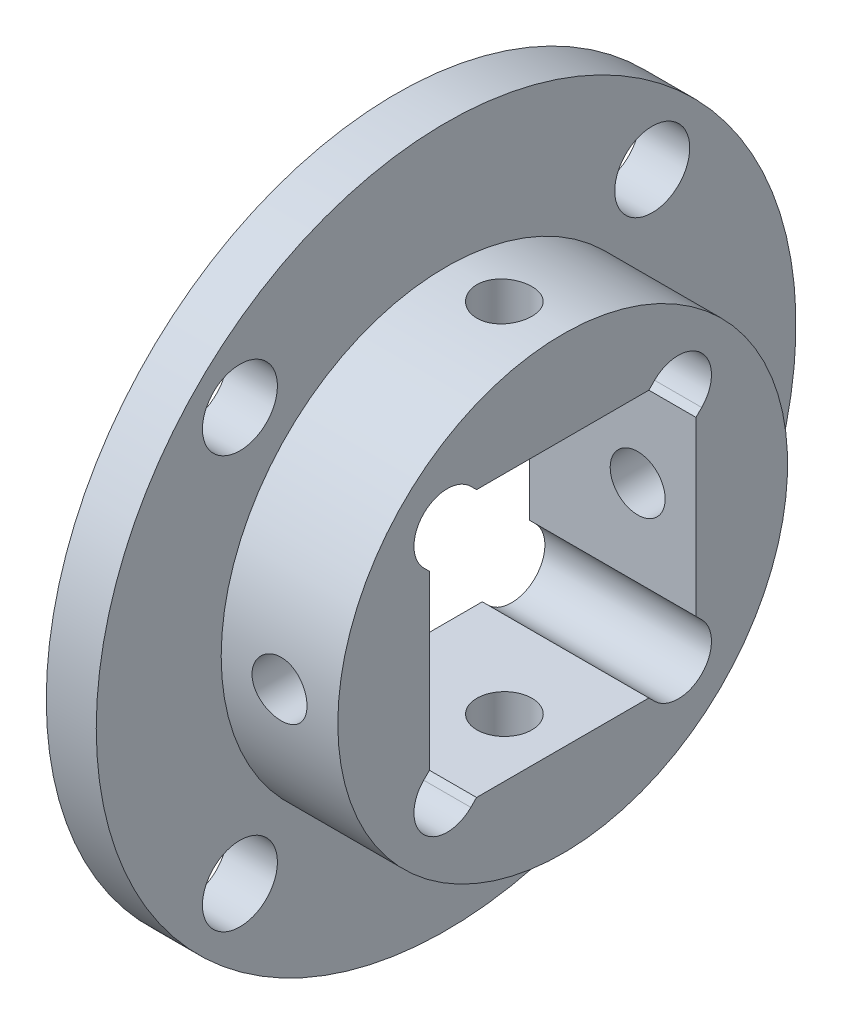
ISO-10303-21;
HEADER;
FILE_DESCRIPTION(('STEP AP214'),'2;1');
FILE_NAME('part.step','',(''),(''),'','','');
FILE_SCHEMA(('AUTOMOTIVE_DESIGN { 1 0 10303 214 1 1 1 1 }'));
ENDSEC;
DATA;
#1=APPLICATION_CONTEXT('core data for automotive mechanical design processes');
#2=APPLICATION_PROTOCOL_DEFINITION('international standard','automotive_design',2000,#1);
#3=PRODUCT_CONTEXT('',#1,'mechanical');
#4=PRODUCT('Part','Part','',(#3));
#5=PRODUCT_RELATED_PRODUCT_CATEGORY('part','',(#4));
#6=PRODUCT_DEFINITION_FORMATION('','',#4);
#7=PRODUCT_DEFINITION_CONTEXT('part definition',#1,'design');
#8=PRODUCT_DEFINITION('design','',#6,#7);
#9=PRODUCT_DEFINITION_SHAPE('','',#8);
#10=(LENGTH_UNIT() NAMED_UNIT(*) SI_UNIT(.MILLI.,.METRE.));
#11=(NAMED_UNIT(*) PLANE_ANGLE_UNIT() SI_UNIT($,.RADIAN.));
#12=(NAMED_UNIT(*) SI_UNIT($,.STERADIAN.) SOLID_ANGLE_UNIT());
#13=UNCERTAINTY_MEASURE_WITH_UNIT(LENGTH_MEASURE(1.E-05),#10,'distance_accuracy_value','');
#14=(GEOMETRIC_REPRESENTATION_CONTEXT(3) GLOBAL_UNCERTAINTY_ASSIGNED_CONTEXT((#13)) GLOBAL_UNIT_ASSIGNED_CONTEXT((#10,
#11,#12)) REPRESENTATION_CONTEXT('',''));
#15=CARTESIAN_POINT('',(0.,0.,0.));
#16=DIRECTION('',(0.,0.,1.));
#17=DIRECTION('',(1.,0.,0.));
#18=AXIS2_PLACEMENT_3D('',#15,#16,#17);
#19=CARTESIAN_POINT('',(0.,8.,8.));
#20=DIRECTION('',(0.,1.,0.));
#21=DIRECTION('',(0.,0.,1.));
#22=AXIS2_PLACEMENT_3D('',#19,#20,#21);
#23=PLANE('',#22);
#24=DIRECTION('',(0.,0.,1.));
#25=VECTOR('',#24,1.);
#26=CARTESIAN_POINT('',(10.,8.,8.));
#27=LINE('',#26,#25);
#28=CARTESIAN_POINT('',(10.,8.,-5.17157287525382));
#29=VERTEX_POINT('',#28);
#30=CARTESIAN_POINT('',(10.,8.00000000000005,5.17157287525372));
#31=VERTEX_POINT('',#30);
#32=EDGE_CURVE('E296',#29,#31,#27,.T.);
#33=ORIENTED_EDGE('',*,*,#32,.T.);
#34=DIRECTION('',(1.,0.,0.));
#35=VECTOR('',#34,1.);
#36=CARTESIAN_POINT('',(0.,8.00000000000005,5.17157287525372));
#37=LINE('',#36,#35);
#38=CARTESIAN_POINT('',(0.,8.00000000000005,5.17157287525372));
#39=VERTEX_POINT('',#38);
#40=EDGE_CURVE('E180',#39,#31,#37,.T.);
#41=ORIENTED_EDGE('',*,*,#40,.F.);
#42=DIRECTION('',(0.,0.,1.));
#43=VECTOR('',#42,1.);
#44=CARTESIAN_POINT('',(0.,8.,8.));
#45=LINE('',#44,#43);
#46=CARTESIAN_POINT('',(0.,8.,-5.17157287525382));
#47=VERTEX_POINT('',#46);
#48=EDGE_CURVE('E300',#47,#39,#45,.T.);
#49=ORIENTED_EDGE('',*,*,#48,.F.);
#50=DIRECTION('',(1.,0.,0.));
#51=VECTOR('',#50,1.);
#52=CARTESIAN_POINT('',(0.,8.,-5.17157287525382));
#53=LINE('',#52,#51);
#54=EDGE_CURVE('E259',#47,#29,#53,.T.);
#55=ORIENTED_EDGE('',*,*,#54,.T.);
#56=EDGE_LOOP('',(#33,#41,#49,#55));
#57=FACE_BOUND('',#56,.T.);
#58=CARTESIAN_POINT('',(6.5,8.,0.));
#59=DIRECTION('',(0.,-1.,0.));
#60=DIRECTION('',(0.,0.,-1.));
#61=AXIS2_PLACEMENT_3D('',#58,#59,#60);
#62=CIRCLE('',#61,1.64999999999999);
#63=CARTESIAN_POINT('',(6.5,8.,-1.64999999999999));
#64=VERTEX_POINT('',#63);
#65=EDGE_CURVE('E265',#64,#64,#62,.T.);
#66=ORIENTED_EDGE('',*,*,#65,.F.);
#67=EDGE_LOOP('',(#66));
#68=FACE_BOUND('',#67,.T.);
#69=ADVANCED_FACE('F32',(#57,#68),#23,.F.);
#70=CARTESIAN_POINT('',(0.,8.,8.));
#71=DIRECTION('',(0.,0.,1.));
#72=DIRECTION('',(0.,-1.,0.));
#73=AXIS2_PLACEMENT_3D('',#70,#71,#72);
#74=PLANE('',#73);
#75=DIRECTION('',(0.,-1.,0.));
#76=VECTOR('',#75,1.);
#77=CARTESIAN_POINT('',(0.,8.,8.));
#78=LINE('',#77,#76);
#79=CARTESIAN_POINT('',(0.,5.1715728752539,7.99999999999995));
#80=VERTEX_POINT('',#79);
#81=CARTESIAN_POINT('',(0.,-5.17157287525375,8.00000000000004));
#82=VERTEX_POINT('',#81);
#83=EDGE_CURVE('E293',#80,#82,#78,.T.);
#84=ORIENTED_EDGE('',*,*,#83,.F.);
#85=DIRECTION('',(1.,0.,0.));
#86=VECTOR('',#85,1.);
#87=CARTESIAN_POINT('',(0.,5.1715728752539,7.99999999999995));
#88=LINE('',#87,#86);
#89=CARTESIAN_POINT('',(10.,5.1715728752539,7.99999999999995));
#90=VERTEX_POINT('',#89);
#91=EDGE_CURVE('E157',#80,#90,#88,.T.);
#92=ORIENTED_EDGE('',*,*,#91,.T.);
#93=DIRECTION('',(0.,-1.,0.));
#94=VECTOR('',#93,1.);
#95=CARTESIAN_POINT('',(10.,8.,8.));
#96=LINE('',#95,#94);
#97=CARTESIAN_POINT('',(10.,-5.17157287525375,8.00000000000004));
#98=VERTEX_POINT('',#97);
#99=EDGE_CURVE('E303',#90,#98,#96,.T.);
#100=ORIENTED_EDGE('',*,*,#99,.T.);
#101=DIRECTION('',(1.,0.,0.));
#102=VECTOR('',#101,1.);
#103=CARTESIAN_POINT('',(0.,-5.17157287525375,8.00000000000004));
#104=LINE('',#103,#102);
#105=EDGE_CURVE('E202',#82,#98,#104,.T.);
#106=ORIENTED_EDGE('',*,*,#105,.F.);
#107=EDGE_LOOP('',(#84,#92,#100,#106));
#108=FACE_BOUND('',#107,.T.);
#109=CARTESIAN_POINT('',(6.5,0.,8.));
#110=DIRECTION('',(0.,0.,-1.));
#111=DIRECTION('',(0.,1.,0.));
#112=AXIS2_PLACEMENT_3D('',#109,#110,#111);
#113=CIRCLE('',#112,1.64999999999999);
#114=CARTESIAN_POINT('',(6.5,1.65000000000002,7.99999999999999));
#115=VERTEX_POINT('',#114);
#116=EDGE_CURVE('E269',#115,#115,#113,.T.);
#117=ORIENTED_EDGE('',*,*,#116,.F.);
#118=EDGE_LOOP('',(#117));
#119=FACE_BOUND('',#118,.T.);
#120=ADVANCED_FACE('F365',(#108,#119),#74,.F.);
#121=CARTESIAN_POINT('',(0.,-8.,8.));
#122=DIRECTION('',(0.,-1.,0.));
#123=DIRECTION('',(0.,0.,-1.));
#124=AXIS2_PLACEMENT_3D('',#121,#122,#123);
#125=PLANE('',#124);
#126=DIRECTION('',(0.,0.,-1.));
#127=VECTOR('',#126,1.);
#128=CARTESIAN_POINT('',(0.,-8.,8.));
#129=LINE('',#128,#127);
#130=CARTESIAN_POINT('',(0.,-7.99999999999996,5.17157287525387));
#131=VERTEX_POINT('',#130);
#132=CARTESIAN_POINT('',(0.,-8.00000000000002,-5.17157287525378));
#133=VERTEX_POINT('',#132);
#134=EDGE_CURVE('E295',#131,#133,#129,.T.);
#135=ORIENTED_EDGE('',*,*,#134,.F.);
#136=DIRECTION('',(1.,0.,0.));
#137=VECTOR('',#136,1.);
#138=CARTESIAN_POINT('',(0.,-7.99999999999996,5.17157287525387));
#139=LINE('',#138,#137);
#140=CARTESIAN_POINT('',(10.,-7.99999999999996,5.17157287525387));
#141=VERTEX_POINT('',#140);
#142=EDGE_CURVE('E205',#131,#141,#139,.T.);
#143=ORIENTED_EDGE('',*,*,#142,.T.);
#144=DIRECTION('',(0.,0.,-1.));
#145=VECTOR('',#144,1.);
#146=CARTESIAN_POINT('',(10.,-8.,8.));
#147=LINE('',#146,#145);
#148=CARTESIAN_POINT('',(10.,-8.00000000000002,-5.17157287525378));
#149=VERTEX_POINT('',#148);
#150=EDGE_CURVE('E305',#141,#149,#147,.T.);
#151=ORIENTED_EDGE('',*,*,#150,.T.);
#152=DIRECTION('',(1.,0.,0.));
#153=VECTOR('',#152,1.);
#154=CARTESIAN_POINT('',(0.,-8.00000000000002,-5.17157287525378));
#155=LINE('',#154,#153);
#156=EDGE_CURVE('E229',#133,#149,#155,.T.);
#157=ORIENTED_EDGE('',*,*,#156,.F.);
#158=EDGE_LOOP('',(#135,#143,#151,#157));
#159=FACE_BOUND('',#158,.T.);
#160=CARTESIAN_POINT('',(6.5,-8.,0.));
#161=DIRECTION('',(0.,1.,0.));
#162=DIRECTION('',(0.,0.,1.));
#163=AXIS2_PLACEMENT_3D('',#160,#161,#162);
#164=CIRCLE('',#163,1.64999999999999);
#165=CARTESIAN_POINT('',(6.5,-8.,1.64999999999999));
#166=VERTEX_POINT('',#165);
#167=EDGE_CURVE('E273',#166,#166,#164,.T.);
#168=ORIENTED_EDGE('',*,*,#167,.F.);
#169=EDGE_LOOP('',(#168));
#170=FACE_BOUND('',#169,.T.);
#171=ADVANCED_FACE('F371',(#159,#170),#125,.F.);
#172=CARTESIAN_POINT('',(0.,0.,0.));
#173=DIRECTION('',(1.,0.,0.));
#174=DIRECTION('',(0.,0.,-1.));
#175=AXIS2_PLACEMENT_3D('',#172,#173,#174);
#176=PLANE('',#175);
#177=CARTESIAN_POINT('',(0.,-12.3743686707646,12.3743686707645));
#178=DIRECTION('',(1.,0.,0.));
#179=DIRECTION('',(0.,0.,-1.));
#180=AXIS2_PLACEMENT_3D('',#177,#178,#179);
#181=CIRCLE('',#180,2.25);
#182=CARTESIAN_POINT('',(0.,-12.3743686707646,10.1243686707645));
#183=VERTEX_POINT('',#182);
#184=EDGE_CURVE('E277',#183,#183,#181,.T.);
#185=ORIENTED_EDGE('',*,*,#184,.T.);
#186=EDGE_LOOP('',(#185));
#187=FACE_BOUND('',#186,.T.);
#188=CARTESIAN_POINT('',(0.,-12.3743686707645,-12.3743686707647));
#189=DIRECTION('',(1.,0.,0.));
#190=DIRECTION('',(0.,0.,-1.));
#191=AXIS2_PLACEMENT_3D('',#188,#189,#190);
#192=CIRCLE('',#191,2.25);
#193=CARTESIAN_POINT('',(0.,-12.3743686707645,-14.6243686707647));
#194=VERTEX_POINT('',#193);
#195=EDGE_CURVE('E281',#194,#194,#192,.T.);
#196=ORIENTED_EDGE('',*,*,#195,.T.);
#197=EDGE_LOOP('',(#196));
#198=FACE_BOUND('',#197,.T.);
#199=CARTESIAN_POINT('',(0.,12.3743686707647,-12.3743686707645));
#200=DIRECTION('',(1.,0.,0.));
#201=DIRECTION('',(0.,0.,-1.));
#202=AXIS2_PLACEMENT_3D('',#199,#200,#201);
#203=CIRCLE('',#202,2.25);
#204=CARTESIAN_POINT('',(0.,12.3743686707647,-14.6243686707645));
#205=VERTEX_POINT('',#204);
#206=EDGE_CURVE('E285',#205,#205,#203,.T.);
#207=ORIENTED_EDGE('',*,*,#206,.T.);
#208=EDGE_LOOP('',(#207));
#209=FACE_BOUND('',#208,.T.);
#210=CARTESIAN_POINT('',(0.,12.3743686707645,12.3743686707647));
#211=DIRECTION('',(1.,0.,0.));
#212=DIRECTION('',(0.,0.,-1.));
#213=AXIS2_PLACEMENT_3D('',#210,#211,#212);
#214=CIRCLE('',#213,2.25);
#215=CARTESIAN_POINT('',(0.,12.3743686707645,10.1243686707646));
#216=VERTEX_POINT('',#215);
#217=EDGE_CURVE('E289',#216,#216,#214,.T.);
#218=ORIENTED_EDGE('',*,*,#217,.T.);
#219=EDGE_LOOP('',(#218));
#220=FACE_BOUND('',#219,.T.);
#221=ORIENTED_EDGE('',*,*,#48,.T.);
#222=DIRECTION('',(0.,0.707106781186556,0.707106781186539));
#223=VECTOR('',#222,1.);
#224=CARTESIAN_POINT('',(0.,8.34386001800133,5.51543289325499));
#225=LINE('',#224,#223);
#226=CARTESIAN_POINT('',(0.,8.34386001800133,5.51543289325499));
#227=VERTEX_POINT('',#226);
#228=EDGE_CURVE('E158',#39,#227,#225,.T.);
#229=ORIENTED_EDGE('',*,*,#228,.T.);
#230=CARTESIAN_POINT('',(0.,6.92964645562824,6.92964645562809));
#231=DIRECTION('',(1.,0.,0.));
#232=DIRECTION('',(0.,0.,-1.));
#233=AXIS2_PLACEMENT_3D('',#230,#231,#232);
#234=CIRCLE('',#233,2.);
#235=CARTESIAN_POINT('',(0.,5.51543289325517,8.34386001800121));
#236=VERTEX_POINT('',#235);
#237=EDGE_CURVE('E153',#227,#236,#234,.T.);
#238=ORIENTED_EDGE('',*,*,#237,.T.);
#239=DIRECTION('',(0.,-0.70710678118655,-0.707106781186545));
#240=VECTOR('',#239,1.);
#241=CARTESIAN_POINT('',(0.,5.51543289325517,8.34386001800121));
#242=LINE('',#241,#240);
#243=EDGE_CURVE('E161',#236,#80,#242,.T.);
#244=ORIENTED_EDGE('',*,*,#243,.T.);
#245=ORIENTED_EDGE('',*,*,#83,.T.);
#246=DIRECTION('',(0.,-0.707106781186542,0.707106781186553));
#247=VECTOR('',#246,1.);
#248=CARTESIAN_POINT('',(0.,-5.51543289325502,8.34386001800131));
#249=LINE('',#248,#247);
#250=CARTESIAN_POINT('',(0.,-5.51543289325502,8.34386001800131));
#251=VERTEX_POINT('',#250);
#252=EDGE_CURVE('E190',#82,#251,#249,.T.);
#253=ORIENTED_EDGE('',*,*,#252,.T.);
#254=CARTESIAN_POINT('',(0.,-6.92964645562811,6.92964645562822));
#255=DIRECTION('',(1.,0.,0.));
#256=DIRECTION('',(0.,0.,-1.));
#257=AXIS2_PLACEMENT_3D('',#254,#255,#256);
#258=CIRCLE('',#257,2.);
#259=CARTESIAN_POINT('',(0.,-8.34386001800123,5.51543289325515));
#260=VERTEX_POINT('',#259);
#261=EDGE_CURVE('E183',#251,#260,#258,.T.);
#262=ORIENTED_EDGE('',*,*,#261,.T.);
#263=DIRECTION('',(0.,0.707106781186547,-0.707106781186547));
#264=VECTOR('',#263,1.);
#265=CARTESIAN_POINT('',(0.,-8.34386001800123,5.51543289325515));
#266=LINE('',#265,#264);
#267=EDGE_CURVE('E186',#260,#131,#266,.T.);
#268=ORIENTED_EDGE('',*,*,#267,.T.);
#269=ORIENTED_EDGE('',*,*,#134,.T.);
#270=DIRECTION('',(0.,-0.707106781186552,-0.707106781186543));
#271=VECTOR('',#270,1.);
#272=CARTESIAN_POINT('',(0.,-8.34386001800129,-5.51543289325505));
#273=LINE('',#272,#271);
#274=CARTESIAN_POINT('',(0.,-8.34386001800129,-5.51543289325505));
#275=VERTEX_POINT('',#274);
#276=EDGE_CURVE('E216',#133,#275,#273,.T.);
#277=ORIENTED_EDGE('',*,*,#276,.T.);
#278=CARTESIAN_POINT('',(0.,-6.92964645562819,-6.92964645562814));
#279=DIRECTION('',(1.,0.,0.));
#280=DIRECTION('',(0.,0.,-1.));
#281=AXIS2_PLACEMENT_3D('',#278,#279,#280);
#282=CIRCLE('',#281,2.);
#283=CARTESIAN_POINT('',(0.,-5.51543289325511,-8.34386001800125));
#284=VERTEX_POINT('',#283);
#285=EDGE_CURVE('E209',#275,#284,#282,.T.);
#286=ORIENTED_EDGE('',*,*,#285,.T.);
#287=DIRECTION('',(0.,0.707106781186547,0.707106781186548));
#288=VECTOR('',#287,1.);
#289=CARTESIAN_POINT('',(0.,-5.51543289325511,-8.34386001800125));
#290=LINE('',#289,#288);
#291=CARTESIAN_POINT('',(0.,-5.17157287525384,-7.99999999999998));
#292=VERTEX_POINT('',#291);
#293=EDGE_CURVE('E212',#284,#292,#290,.T.);
#294=ORIENTED_EDGE('',*,*,#293,.T.);
#295=DIRECTION('',(0.,1.,0.));
#296=VECTOR('',#295,1.);
#297=CARTESIAN_POINT('',(0.,8.,-8.));
#298=LINE('',#297,#296);
#299=CARTESIAN_POINT('',(0.,5.17157287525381,-8.));
#300=VERTEX_POINT('',#299);
#301=EDGE_CURVE('E298',#292,#300,#298,.T.);
#302=ORIENTED_EDGE('',*,*,#301,.T.);
#303=DIRECTION('',(0.,0.707106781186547,-0.707106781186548));
#304=VECTOR('',#303,1.);
#305=CARTESIAN_POINT('',(0.,5.51543289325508,-8.34386001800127));
#306=LINE('',#305,#304);
#307=CARTESIAN_POINT('',(0.,5.51543289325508,-8.34386001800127));
#308=VERTEX_POINT('',#307);
#309=EDGE_CURVE('E243',#300,#308,#306,.T.);
#310=ORIENTED_EDGE('',*,*,#309,.T.);
#311=CARTESIAN_POINT('',(0.,6.92964645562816,-6.92964645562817));
#312=DIRECTION('',(1.,0.,0.));
#313=DIRECTION('',(0.,0.,-1.));
#314=AXIS2_PLACEMENT_3D('',#311,#312,#313);
#315=CIRCLE('',#314,2.);
#316=CARTESIAN_POINT('',(0.,8.34386001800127,-5.51543289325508));
#317=VERTEX_POINT('',#316);
#318=EDGE_CURVE('E236',#308,#317,#315,.T.);
#319=ORIENTED_EDGE('',*,*,#318,.T.);
#320=DIRECTION('',(0.,-0.707106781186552,0.707106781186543));
#321=VECTOR('',#320,1.);
#322=CARTESIAN_POINT('',(0.,8.34386001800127,-5.51543289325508));
#323=LINE('',#322,#321);
#324=EDGE_CURVE('E239',#317,#47,#323,.T.);
#325=ORIENTED_EDGE('',*,*,#324,.T.);
#326=EDGE_LOOP('',(#221,#229,#238,#244,#245,#253,#262,#268,#269,#277,#286,#294,#302,#310,#319,#325));
#327=FACE_BOUND('',#326,.T.);
#328=CARTESIAN_POINT('',(0.,0.,0.));
#329=DIRECTION('',(-1.,0.,0.));
#330=DIRECTION('',(0.,0.,1.));
#331=AXIS2_PLACEMENT_3D('',#328,#329,#330);
#332=CIRCLE('',#331,21.);
#333=CARTESIAN_POINT('',(0.,0.,21.));
#334=VERTEX_POINT('',#333);
#335=EDGE_CURVE('E11',#334,#334,#332,.T.);
#336=ORIENTED_EDGE('',*,*,#335,.T.);
#337=EDGE_LOOP('',(#336));
#338=FACE_BOUND('',#337,.T.);
#339=ADVANCED_FACE('F34',(#187,#198,#209,#220,#327,#338),#176,.F.);
#340=CARTESIAN_POINT('',(-19.0972157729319,0.,0.));
#341=DIRECTION('',(-1.,0.,0.));
#342=DIRECTION('',(0.,0.,1.));
#343=AXIS2_PLACEMENT_3D('',#340,#341,#342);
#344=CYLINDRICAL_SURFACE('',#343,21.);
#345=ORIENTED_EDGE('',*,*,#335,.F.);
#346=EDGE_LOOP('',(#345));
#347=FACE_BOUND('',#346,.T.);
#348=CARTESIAN_POINT('',(3.,0.,0.));
#349=DIRECTION('',(-1.,0.,0.));
#350=DIRECTION('',(0.,0.,1.));
#351=AXIS2_PLACEMENT_3D('',#348,#349,#350);
#352=CIRCLE('',#351,21.);
#353=CARTESIAN_POINT('',(3.,0.,21.));
#354=VERTEX_POINT('',#353);
#355=EDGE_CURVE('E45',#354,#354,#352,.T.);
#356=ORIENTED_EDGE('',*,*,#355,.T.);
#357=EDGE_LOOP('',(#356));
#358=FACE_BOUND('',#357,.T.);
#359=ADVANCED_FACE('F488',(#347,#358),#344,.T.);
#360=CARTESIAN_POINT('',(3.,-21.,1.46642216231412E-13));
#361=DIRECTION('',(-1.,0.,0.));
#362=DIRECTION('',(0.,0.,1.));
#363=AXIS2_PLACEMENT_3D('',#360,#361,#362);
#364=PLANE('',#363);
#365=CARTESIAN_POINT('',(3.,-12.3743686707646,12.3743686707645));
#366=DIRECTION('',(-1.,0.,0.));
#367=DIRECTION('',(0.,0.,1.));
#368=AXIS2_PLACEMENT_3D('',#365,#366,#367);
#369=CIRCLE('',#368,2.25);
#370=CARTESIAN_POINT('',(3.,-12.3743686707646,14.6243686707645));
#371=VERTEX_POINT('',#370);
#372=EDGE_CURVE('E280',#371,#371,#369,.T.);
#373=ORIENTED_EDGE('',*,*,#372,.T.);
#374=EDGE_LOOP('',(#373));
#375=FACE_BOUND('',#374,.T.);
#376=CARTESIAN_POINT('',(3.,-12.3743686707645,-12.3743686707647));
#377=DIRECTION('',(-1.,0.,0.));
#378=DIRECTION('',(0.,0.,1.));
#379=AXIS2_PLACEMENT_3D('',#376,#377,#378);
#380=CIRCLE('',#379,2.25);
#381=CARTESIAN_POINT('',(3.,-12.3743686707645,-10.1243686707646));
#382=VERTEX_POINT('',#381);
#383=EDGE_CURVE('E284',#382,#382,#380,.T.);
#384=ORIENTED_EDGE('',*,*,#383,.T.);
#385=EDGE_LOOP('',(#384));
#386=FACE_BOUND('',#385,.T.);
#387=CARTESIAN_POINT('',(3.,12.3743686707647,-12.3743686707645));
#388=DIRECTION('',(-1.,0.,0.));
#389=DIRECTION('',(0.,0.,1.));
#390=AXIS2_PLACEMENT_3D('',#387,#388,#389);
#391=CIRCLE('',#390,2.25);
#392=CARTESIAN_POINT('',(3.,12.3743686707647,-10.1243686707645));
#393=VERTEX_POINT('',#392);
#394=EDGE_CURVE('E288',#393,#393,#391,.T.);
#395=ORIENTED_EDGE('',*,*,#394,.T.);
#396=EDGE_LOOP('',(#395));
#397=FACE_BOUND('',#396,.T.);
#398=CARTESIAN_POINT('',(3.,12.3743686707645,12.3743686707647));
#399=DIRECTION('',(-1.,0.,0.));
#400=DIRECTION('',(0.,0.,1.));
#401=AXIS2_PLACEMENT_3D('',#398,#399,#400);
#402=CIRCLE('',#401,2.25);
#403=CARTESIAN_POINT('',(3.,12.3743686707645,14.6243686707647));
#404=VERTEX_POINT('',#403);
#405=EDGE_CURVE('E292',#404,#404,#402,.T.);
#406=ORIENTED_EDGE('',*,*,#405,.T.);
#407=EDGE_LOOP('',(#406));
#408=FACE_BOUND('',#407,.T.);
#409=ORIENTED_EDGE('',*,*,#355,.F.);
#410=EDGE_LOOP('',(#409));
#411=FACE_BOUND('',#410,.T.);
#412=CARTESIAN_POINT('',(3.,0.,0.));
#413=DIRECTION('',(-1.,0.,0.));
#414=DIRECTION('',(0.,0.,1.));
#415=AXIS2_PLACEMENT_3D('',#412,#413,#414);
#416=CIRCLE('',#415,13.5);
#417=CARTESIAN_POINT('',(3.,0.,13.5));
#418=VERTEX_POINT('',#417);
#419=EDGE_CURVE('E313',#418,#418,#416,.T.);
#420=ORIENTED_EDGE('',*,*,#419,.T.);
#421=EDGE_LOOP('',(#420));
#422=FACE_BOUND('',#421,.T.);
#423=ADVANCED_FACE('F382',(#375,#386,#397,#408,#411,#422),#364,.F.);
#424=CARTESIAN_POINT('',(-19.0972157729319,0.,0.));
#425=DIRECTION('',(-1.,0.,0.));
#426=DIRECTION('',(0.,0.,1.));
#427=AXIS2_PLACEMENT_3D('',#424,#425,#426);
#428=CYLINDRICAL_SURFACE('',#427,13.5);
#429=CARTESIAN_POINT('',(6.5,-1.65000000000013,-13.3987872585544));
#430=CARTESIAN_POINT('',(6.59230909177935,-1.64999606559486,-13.398788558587));
#431=CARTESIAN_POINT('',(6.68467628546,-1.6422275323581,-13.3997514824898));
#432=CARTESIAN_POINT('',(6.86684126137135,-1.61135947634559,-13.4034977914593));
#433=CARTESIAN_POINT('',(6.95663623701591,-1.58824382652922,-13.4062830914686));
#434=CARTESIAN_POINT('',(7.1309928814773,-1.52737214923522,-13.4133540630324));
#435=CARTESIAN_POINT('',(7.21555801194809,-1.48962592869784,-13.417638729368));
#436=CARTESIAN_POINT('',(7.37713746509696,-1.40058532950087,-13.4272244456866));
#437=CARTESIAN_POINT('',(7.45415310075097,-1.34929331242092,-13.4325253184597));
#438=CARTESIAN_POINT('',(7.59887600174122,-1.23432269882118,-13.4435779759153));
#439=CARTESIAN_POINT('',(7.66653698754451,-1.17058603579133,-13.4493317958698));
#440=CARTESIAN_POINT('',(7.7902303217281,-1.03266029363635,-13.4606237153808));
#441=CARTESIAN_POINT('',(7.84626209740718,-0.958470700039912,-13.4661618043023));
#442=CARTESIAN_POINT('',(7.94527185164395,-0.801454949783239,-13.4764190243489));
#443=CARTESIAN_POINT('',(7.98820804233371,-0.718602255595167,-13.4811355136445));
#444=CARTESIAN_POINT('',(8.0595402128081,-0.546795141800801,-13.489195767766));
#445=CARTESIAN_POINT('',(8.08793670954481,-0.457840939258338,-13.4925395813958));
#446=CARTESIAN_POINT('',(8.12924540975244,-0.276828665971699,-13.4974633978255));
#447=CARTESIAN_POINT('',(8.14223446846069,-0.184788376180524,-13.4990521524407));
#448=CARTESIAN_POINT('',(8.15259772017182,0.000178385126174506,-13.5003167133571));
#449=CARTESIAN_POINT('',(8.14997250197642,0.0931048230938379,-13.4999925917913));
#450=CARTESIAN_POINT('',(8.1292434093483,0.276683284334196,-13.4974750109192));
#451=CARTESIAN_POINT('',(8.11122218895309,0.367344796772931,-13.495291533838));
#452=CARTESIAN_POINT('',(8.06034179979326,0.54434696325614,-13.48931181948));
#453=CARTESIAN_POINT('',(8.02748235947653,0.630687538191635,-13.4855155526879));
#454=CARTESIAN_POINT('',(7.94777006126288,0.796853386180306,-13.4767196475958));
#455=CARTESIAN_POINT('',(7.90088133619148,0.876661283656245,-13.4717169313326));
#456=CARTESIAN_POINT('',(7.79446755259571,1.02730677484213,-13.4610680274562));
#457=CARTESIAN_POINT('',(7.73494193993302,1.09814397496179,-13.4554218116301));
#458=CARTESIAN_POINT('',(7.60448092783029,1.22932267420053,-13.444074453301));
#459=CARTESIAN_POINT('',(7.53347351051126,1.28959256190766,-13.4383731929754));
#460=CARTESIAN_POINT('',(7.38231220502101,1.39736949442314,-13.427594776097));
#461=CARTESIAN_POINT('',(7.3021582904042,1.44487650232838,-13.4225176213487));
#462=CARTESIAN_POINT('',(7.13491652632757,1.52578267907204,-13.4135622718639));
#463=CARTESIAN_POINT('',(7.04782595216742,1.55917627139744,-13.4096845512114));
#464=CARTESIAN_POINT('',(6.869215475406,1.61084502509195,-13.4035764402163));
#465=CARTESIAN_POINT('',(6.77769577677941,1.62912088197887,-13.4013459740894));
#466=CARTESIAN_POINT('',(6.59345696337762,1.64994087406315,-13.39879868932));
#467=CARTESIAN_POINT('',(6.50074939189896,1.65258571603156,-13.3984696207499));
#468=CARTESIAN_POINT('',(6.31621246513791,1.64233416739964,-13.399730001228));
#469=CARTESIAN_POINT('',(6.22438309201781,1.62943809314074,-13.4013194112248));
#470=CARTESIAN_POINT('',(6.04451004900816,1.58855551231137,-13.4062264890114));
#471=CARTESIAN_POINT('',(5.95645516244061,1.56061763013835,-13.409538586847));
#472=CARTESIAN_POINT('',(5.78628001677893,1.49049449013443,-13.4175133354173));
#473=CARTESIAN_POINT('',(5.70415995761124,1.44830875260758,-13.4221760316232));
#474=CARTESIAN_POINT('',(5.54772950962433,1.35063922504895,-13.4323559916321));
#475=CARTESIAN_POINT('',(5.47346068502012,1.29508930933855,-13.4378774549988));
#476=CARTESIAN_POINT('',(5.33526469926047,1.17236191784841,-13.449139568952));
#477=CARTESIAN_POINT('',(5.27133792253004,1.10518401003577,-13.4548802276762));
#478=CARTESIAN_POINT('',(5.1552877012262,0.960668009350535,-13.465971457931));
#479=CARTESIAN_POINT('',(5.1032303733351,0.883276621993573,-13.471319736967));
#480=CARTESIAN_POINT('',(5.01285394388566,0.720790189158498,-13.4809894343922));
#481=CARTESIAN_POINT('',(4.97453457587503,0.635695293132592,-13.4853108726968));
#482=CARTESIAN_POINT('',(4.91283134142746,0.460438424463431,-13.4924297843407));
#483=CARTESIAN_POINT('',(4.88940905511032,0.370290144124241,-13.4952311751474));
#484=CARTESIAN_POINT('',(4.85803982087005,0.187303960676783,-13.4990105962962));
#485=CARTESIAN_POINT('',(4.8500922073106,0.094466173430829,-13.499988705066));
#486=CARTESIAN_POINT('',(4.8499099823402,-0.0906176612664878,-13.5000110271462));
#487=CARTESIAN_POINT('',(4.85757333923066,-0.182863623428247,-13.4990677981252));
#488=CARTESIAN_POINT('',(4.88817968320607,-0.364746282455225,-13.4953783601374));
#489=CARTESIAN_POINT('',(4.91112266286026,-0.454382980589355,-13.4926321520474));
#490=CARTESIAN_POINT('',(4.97160538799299,-0.628490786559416,-13.4856440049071));
#491=CARTESIAN_POINT('',(5.00914047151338,-0.712963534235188,-13.4814025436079));
#492=CARTESIAN_POINT('',(5.0977313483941,-0.874427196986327,-13.4718939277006));
#493=CARTESIAN_POINT('',(5.14878727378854,-0.951418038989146,-13.4666267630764));
#494=CARTESIAN_POINT('',(5.26334878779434,-1.09625394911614,-13.4556138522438));
#495=CARTESIAN_POINT('',(5.32693032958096,-1.16403873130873,-13.4498653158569));
#496=CARTESIAN_POINT('',(5.46458104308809,-1.28801713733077,-13.438560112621));
#497=CARTESIAN_POINT('',(5.53865269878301,-1.34420800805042,-13.4330034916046));
#498=CARTESIAN_POINT('',(5.69549363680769,-1.44357982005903,-13.4226893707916));
#499=CARTESIAN_POINT('',(5.77829404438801,-1.48671192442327,-13.4179348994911));
#500=CARTESIAN_POINT('',(5.94997378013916,-1.55839846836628,-13.4097989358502));
#501=CARTESIAN_POINT('',(6.03884634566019,-1.58696883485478,-13.4064159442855));
#502=CARTESIAN_POINT('',(6.19015365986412,-1.62184595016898,-13.4022312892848));
#503=CARTESIAN_POINT('',(6.2516323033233,-1.6323886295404,-13.4009461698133));
#504=CARTESIAN_POINT('',(6.37539847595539,-1.64646695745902,-13.3992237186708));
#505=CARTESIAN_POINT('',(6.43768599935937,-1.65000265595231,-13.3987863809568));
#506=CARTESIAN_POINT('',(6.5,-1.65000000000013,-13.3987872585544));
#507=B_SPLINE_CURVE_WITH_KNOTS('',3,(#429,#430,#431,#432,#433,#434,#435,#436,#437,#438,#439,
#440,#441,#442,#443,#444,#445,#446,#447,#448,#449,#450,#451,#452,#453,#454,#455,#456,#457,#458,
#459,#460,#461,#462,#463,#464,#465,#466,#467,#468,#469,#470,#471,#472,#473,#474,#475,#476,#477,
#478,#479,#480,#481,#482,#483,#484,#485,#486,#487,#488,#489,#490,#491,#492,#493,#494,#495,#496,
#497,#498,#499,#500,#501,#502,#503,#504,#505,#506),.UNSPECIFIED.,.T.,.F.,(4,2,2,2,2,2,2,2,2,2,2,
2,2,2,2,2,2,2,2,2,2,2,2,2,2,2,2,2,2,2,2,2,2,2,2,2,2,2,4),(0.,0.276699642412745,
0.553690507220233,0.830496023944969,1.10725331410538,1.38533421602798,1.66342880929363,
1.9424017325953,2.22136473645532,2.4989302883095,2.7764853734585,3.05255968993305,
3.32863905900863,3.60543037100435,3.88223382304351,4.16084610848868,4.43945919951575,
4.71818227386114,4.99689252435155,5.27380513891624,5.55071211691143,5.82672928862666,
6.10275575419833,6.3801771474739,6.65760885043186,6.93655010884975,7.21548595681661,
7.49369947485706,7.77190102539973,8.04829011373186,8.3246790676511,8.60097979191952,
8.87728321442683,9.15531674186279,9.43341621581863,9.71254322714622,9.99136428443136,
10.1781539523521,10.3649422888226),.UNSPECIFIED.);
#508=CARTESIAN_POINT('',(6.5,-1.65000000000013,-13.3987872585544));
#509=VERTEX_POINT('',#508);
#510=EDGE_CURVE('E36',#509,#509,#507,.T.);
#511=ORIENTED_EDGE('',*,*,#510,.T.);
#512=EDGE_LOOP('',(#511));
#513=FACE_BOUND('',#512,.T.);
#514=CARTESIAN_POINT('',(6.5,13.3987872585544,-1.64999999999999));
#515=CARTESIAN_POINT('',(6.59230909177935,13.398788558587,-1.64999606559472));
#516=CARTESIAN_POINT('',(6.68467628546,13.3997514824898,-1.64222753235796));
#517=CARTESIAN_POINT('',(6.86684126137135,13.4034977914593,-1.61135947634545));
#518=CARTESIAN_POINT('',(6.95663623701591,13.4062830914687,-1.58824382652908));
#519=CARTESIAN_POINT('',(7.1309928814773,13.4133540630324,-1.52737214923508));
#520=CARTESIAN_POINT('',(7.21555801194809,13.417638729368,-1.4896259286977));
#521=CARTESIAN_POINT('',(7.37713746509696,13.4272244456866,-1.40058532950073));
#522=CARTESIAN_POINT('',(7.45415310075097,13.4325253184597,-1.34929331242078));
#523=CARTESIAN_POINT('',(7.59887600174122,13.4435779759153,-1.23432269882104));
#524=CARTESIAN_POINT('',(7.66653698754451,13.4493317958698,-1.17058603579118));
#525=CARTESIAN_POINT('',(7.7902303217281,13.4606237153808,-1.03266029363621));
#526=CARTESIAN_POINT('',(7.84626209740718,13.4661618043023,-0.958470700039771));
#527=CARTESIAN_POINT('',(7.94527185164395,13.4764190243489,-0.801454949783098));
#528=CARTESIAN_POINT('',(7.98820804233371,13.4811355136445,-0.718602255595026));
#529=CARTESIAN_POINT('',(8.0595402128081,13.489195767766,-0.546795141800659));
#530=CARTESIAN_POINT('',(8.08793670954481,13.4925395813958,-0.457840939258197));
#531=CARTESIAN_POINT('',(8.12924540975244,13.4974633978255,-0.276828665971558));
#532=CARTESIAN_POINT('',(8.14223446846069,13.4990521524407,-0.184788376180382));
#533=CARTESIAN_POINT('',(8.15259772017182,13.5003167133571,0.000178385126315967));
#534=CARTESIAN_POINT('',(8.14997250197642,13.4999925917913,0.0931048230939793));
#535=CARTESIAN_POINT('',(8.1292434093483,13.4974750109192,0.276683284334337));
#536=CARTESIAN_POINT('',(8.11122218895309,13.495291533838,0.367344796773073));
#537=CARTESIAN_POINT('',(8.06034179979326,13.48931181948,0.544346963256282));
#538=CARTESIAN_POINT('',(8.02748235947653,13.4855155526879,0.630687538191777));
#539=CARTESIAN_POINT('',(7.94777006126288,13.4767196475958,0.796853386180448));
#540=CARTESIAN_POINT('',(7.90088133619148,13.4717169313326,0.876661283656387));
#541=CARTESIAN_POINT('',(7.79446755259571,13.4610680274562,1.02730677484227));
#542=CARTESIAN_POINT('',(7.73494193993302,13.4554218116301,1.09814397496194));
#543=CARTESIAN_POINT('',(7.60448092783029,13.4440744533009,1.22932267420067));
#544=CARTESIAN_POINT('',(7.53347351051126,13.4383731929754,1.2895925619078));
#545=CARTESIAN_POINT('',(7.38231220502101,13.427594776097,1.39736949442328));
#546=CARTESIAN_POINT('',(7.3021582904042,13.4225176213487,1.44487650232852));
#547=CARTESIAN_POINT('',(7.13491652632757,13.4135622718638,1.52578267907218));
#548=CARTESIAN_POINT('',(7.04782595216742,13.4096845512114,1.55917627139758));
#549=CARTESIAN_POINT('',(6.869215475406,13.4035764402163,1.61084502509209));
#550=CARTESIAN_POINT('',(6.77769577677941,13.4013459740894,1.62912088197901));
#551=CARTESIAN_POINT('',(6.59345696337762,13.39879868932,1.64994087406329));
#552=CARTESIAN_POINT('',(6.50074939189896,13.3984696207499,1.6525857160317));
#553=CARTESIAN_POINT('',(6.31621246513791,13.3997300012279,1.64233416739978));
#554=CARTESIAN_POINT('',(6.22438309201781,13.4013194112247,1.62943809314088));
#555=CARTESIAN_POINT('',(6.04451004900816,13.4062264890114,1.58855551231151));
#556=CARTESIAN_POINT('',(5.95645516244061,13.4095385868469,1.56061763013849));
#557=CARTESIAN_POINT('',(5.78628001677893,13.4175133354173,1.49049449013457));
#558=CARTESIAN_POINT('',(5.70415995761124,13.4221760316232,1.44830875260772));
#559=CARTESIAN_POINT('',(5.54772950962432,13.432355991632,1.35063922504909));
#560=CARTESIAN_POINT('',(5.47346068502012,13.4378774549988,1.29508930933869));
#561=CARTESIAN_POINT('',(5.33526469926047,13.4491395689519,1.17236191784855));
#562=CARTESIAN_POINT('',(5.27133792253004,13.4548802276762,1.10518401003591));
#563=CARTESIAN_POINT('',(5.1552877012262,13.465971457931,0.960668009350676));
#564=CARTESIAN_POINT('',(5.1032303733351,13.471319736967,0.883276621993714));
#565=CARTESIAN_POINT('',(5.01285394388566,13.4809894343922,0.720790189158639));
#566=CARTESIAN_POINT('',(4.97453457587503,13.4853108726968,0.635695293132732));
#567=CARTESIAN_POINT('',(4.91283134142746,13.4924297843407,0.460438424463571));
#568=CARTESIAN_POINT('',(4.88940905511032,13.4952311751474,0.37029014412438));
#569=CARTESIAN_POINT('',(4.85803982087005,13.4990105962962,0.187303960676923));
#570=CARTESIAN_POINT('',(4.8500922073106,13.499988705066,0.0944661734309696));
#571=CARTESIAN_POINT('',(4.8499099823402,13.5000110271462,-0.0906176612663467));
#572=CARTESIAN_POINT('',(4.85757333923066,13.4990677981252,-0.182863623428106));
#573=CARTESIAN_POINT('',(4.88817968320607,13.4953783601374,-0.364746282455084));
#574=CARTESIAN_POINT('',(4.91112266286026,13.4926321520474,-0.454382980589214));
#575=CARTESIAN_POINT('',(4.97160538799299,13.4856440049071,-0.628490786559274));
#576=CARTESIAN_POINT('',(5.00914047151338,13.4814025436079,-0.712963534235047));
#577=CARTESIAN_POINT('',(5.0977313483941,13.4718939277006,-0.874427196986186));
#578=CARTESIAN_POINT('',(5.14878727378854,13.4666267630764,-0.951418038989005));
#579=CARTESIAN_POINT('',(5.26334878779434,13.4556138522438,-1.096253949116));
#580=CARTESIAN_POINT('',(5.32693032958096,13.4498653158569,-1.16403873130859));
#581=CARTESIAN_POINT('',(5.46458104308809,13.438560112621,-1.28801713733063));
#582=CARTESIAN_POINT('',(5.53865269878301,13.4330034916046,-1.34420800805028));
#583=CARTESIAN_POINT('',(5.69549363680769,13.4226893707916,-1.44357982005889));
#584=CARTESIAN_POINT('',(5.77829404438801,13.4179348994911,-1.48671192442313));
#585=CARTESIAN_POINT('',(5.94997378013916,13.4097989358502,-1.55839846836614));
#586=CARTESIAN_POINT('',(6.03884634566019,13.4064159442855,-1.58696883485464));
#587=CARTESIAN_POINT('',(6.19015365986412,13.4022312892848,-1.62184595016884));
#588=CARTESIAN_POINT('',(6.2516323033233,13.4009461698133,-1.63238862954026));
#589=CARTESIAN_POINT('',(6.37539847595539,13.3992237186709,-1.64646695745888));
#590=CARTESIAN_POINT('',(6.43768599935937,13.3987863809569,-1.65000265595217));
#591=CARTESIAN_POINT('',(6.5,13.3987872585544,-1.64999999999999));
#592=B_SPLINE_CURVE_WITH_KNOTS('',3,(#514,#515,#516,#517,#518,#519,#520,#521,#522,#523,#524,
#525,#526,#527,#528,#529,#530,#531,#532,#533,#534,#535,#536,#537,#538,#539,#540,#541,#542,#543,
#544,#545,#546,#547,#548,#549,#550,#551,#552,#553,#554,#555,#556,#557,#558,#559,#560,#561,#562,
#563,#564,#565,#566,#567,#568,#569,#570,#571,#572,#573,#574,#575,#576,#577,#578,#579,#580,#581,
#582,#583,#584,#585,#586,#587,#588,#589,#590,#591),.UNSPECIFIED.,.T.,.F.,(4,2,2,2,2,2,2,2,2,2,2,
2,2,2,2,2,2,2,2,2,2,2,2,2,2,2,2,2,2,2,2,2,2,2,2,2,2,2,4),(0.,0.276699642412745,
0.553690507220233,0.830496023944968,1.10725331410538,1.38533421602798,1.66342880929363,
1.9424017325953,2.22136473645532,2.4989302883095,2.7764853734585,3.05255968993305,
3.32863905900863,3.60543037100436,3.88223382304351,4.16084610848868,4.43945919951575,
4.71818227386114,4.99689252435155,5.27380513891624,5.55071211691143,5.82672928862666,
6.10275575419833,6.3801771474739,6.65760885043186,6.93655010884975,7.21548595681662,
7.49369947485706,7.77190102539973,8.04829011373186,8.3246790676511,8.60097979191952,
8.87728321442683,9.15531674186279,9.43341621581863,9.71254322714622,9.99136428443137,
10.1781539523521,10.3649422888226),.UNSPECIFIED.);
#593=CARTESIAN_POINT('',(6.5,13.3987872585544,-1.64999999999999));
#594=VERTEX_POINT('',#593);
#595=EDGE_CURVE('E268',#594,#594,#592,.T.);
#596=ORIENTED_EDGE('',*,*,#595,.T.);
#597=EDGE_LOOP('',(#596));
#598=FACE_BOUND('',#597,.T.);
#599=CARTESIAN_POINT('',(8.14999999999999,0.,13.5));
#600=CARTESIAN_POINT('',(8.14999606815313,-0.0923119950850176,13.4999987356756));
#601=CARTESIAN_POINT('',(8.14222706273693,-0.184682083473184,13.4990431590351));
#602=CARTESIAN_POINT('',(8.11135696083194,-0.366853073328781,13.4953230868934));
#603=CARTESIAN_POINT('',(8.08823974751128,-0.456651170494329,13.4925566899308));
#604=CARTESIAN_POINT('',(8.02736349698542,-0.631014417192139,13.4855267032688));
#605=CARTESIAN_POINT('',(7.98961419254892,-0.715583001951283,13.4812641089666));
#606=CARTESIAN_POINT('',(7.90056632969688,-0.877168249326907,13.4717161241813));
#607=CARTESIAN_POINT('',(7.84927014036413,-0.954186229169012,13.4664309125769));
#608=CARTESIAN_POINT('',(7.73429530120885,-1.09890650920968,13.4553968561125));
#609=CARTESIAN_POINT('',(7.67055951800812,-1.1665632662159,13.4496459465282));
#610=CARTESIAN_POINT('',(7.53263731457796,-1.29024843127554,13.4383453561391));
#611=CARTESIAN_POINT('',(7.45845036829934,-1.34627625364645,13.4327956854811));
#612=CARTESIAN_POINT('',(7.30143696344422,-1.44528185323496,13.4225055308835));
#613=CARTESIAN_POINT('',(7.21858351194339,-1.48821712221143,13.4177677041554));
#614=CARTESIAN_POINT('',(7.04677475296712,-1.55954738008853,13.409664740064));
#615=CARTESIAN_POINT('',(6.957819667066,-1.58794289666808,13.4062995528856));
#616=CARTESIAN_POINT('',(6.77680458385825,-1.62924957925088,13.4013425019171));
#617=CARTESIAN_POINT('',(6.68476234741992,-1.64223750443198,13.3997418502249));
#618=CARTESIAN_POINT('',(6.4997917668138,-1.65259781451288,13.3984681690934));
#619=CARTESIAN_POINT('',(6.40686345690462,-1.64997080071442,13.398795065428));
#620=CARTESIAN_POINT('',(6.22329285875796,-1.62923884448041,13.401331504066));
#621=CARTESIAN_POINT('',(6.13264086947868,-1.61121836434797,13.4035307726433));
#622=CARTESIAN_POINT('',(5.95565736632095,-1.56034274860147,13.4095481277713));
#623=CARTESIAN_POINT('',(5.86932593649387,-1.5274873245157,13.4133662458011));
#624=CARTESIAN_POINT('',(5.70317125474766,-1.44778338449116,13.4222027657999));
#625=CARTESIAN_POINT('',(5.62336582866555,-1.40089807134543,13.427224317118));
#626=CARTESIAN_POINT('',(5.47272383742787,-1.2944915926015,13.4378994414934));
#627=CARTESIAN_POINT('',(5.40188766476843,-1.23496987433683,13.443553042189));
#628=CARTESIAN_POINT('',(5.27070464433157,-1.10451165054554,13.4549009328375));
#629=CARTESIAN_POINT('',(5.21043019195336,-1.03350232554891,13.46059524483));
#630=CARTESIAN_POINT('',(5.10264495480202,-0.88233556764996,13.4713479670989));
#631=CARTESIAN_POINT('',(5.05513419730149,-0.80217811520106,13.4764063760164));
#632=CARTESIAN_POINT('',(4.97422531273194,-0.634935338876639,13.4853202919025));
#633=CARTESIAN_POINT('',(4.94083161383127,-0.547847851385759,13.4891754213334));
#634=CARTESIAN_POINT('',(4.88916170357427,-0.369244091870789,13.49524494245));
#635=CARTESIAN_POINT('',(4.87088481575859,-0.277728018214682,13.4974594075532));
#636=CARTESIAN_POINT('',(4.85006092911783,-0.0934909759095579,13.49998856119));
#637=CARTESIAN_POINT('',(4.84741418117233,-0.000781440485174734,13.5003152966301));
#638=CARTESIAN_POINT('',(4.8576626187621,0.183759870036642,13.4990646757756));
#639=CARTESIAN_POINT('',(4.87055748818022,0.275591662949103,13.4974873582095));
#640=CARTESIAN_POINT('',(4.91144026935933,0.455477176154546,13.4926133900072));
#641=CARTESIAN_POINT('',(4.93938072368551,0.543541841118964,13.4893221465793));
#642=CARTESIAN_POINT('',(5.00951227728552,0.713735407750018,13.4813888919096));
#643=CARTESIAN_POINT('',(5.05170384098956,0.795864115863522,13.4767468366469));
#644=CARTESIAN_POINT('',(5.14938202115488,0.952300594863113,13.4665996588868));
#645=CARTESIAN_POINT('',(5.20493328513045,1.02656772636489,13.4610903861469));
#646=CARTESIAN_POINT('',(5.32766236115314,1.16475966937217,13.4498383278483));
#647=CARTESIAN_POINT('',(5.39484061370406,1.22868408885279,13.4440955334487));
#648=CARTESIAN_POINT('',(5.53935561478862,1.34472901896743,13.4329866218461));
#649=CARTESIAN_POINT('',(5.61674559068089,1.39678348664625,13.4276227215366));
#650=CARTESIAN_POINT('',(5.77922841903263,1.48715490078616,13.4179150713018));
#651=CARTESIAN_POINT('',(5.86432112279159,1.52547211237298,13.4135713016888));
#652=CARTESIAN_POINT('',(6.0395792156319,1.58717396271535,13.4064106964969));
#653=CARTESIAN_POINT('',(6.12973124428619,1.61059608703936,13.403590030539));
#654=CARTESIAN_POINT('',(6.31272534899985,1.64196372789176,13.39978391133));
#655=CARTESIAN_POINT('',(6.40556730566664,1.64990993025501,13.3987983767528));
#656=CARTESIAN_POINT('',(6.59064887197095,1.65008795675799,13.3987764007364));
#657=CARTESIAN_POINT('',(6.68288839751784,1.64242353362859,13.3997270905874));
#658=CARTESIAN_POINT('',(6.86475791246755,1.6118173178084,13.4034428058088));
#659=CARTESIAN_POINT('',(6.95438790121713,1.58887552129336,13.4062078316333));
#660=CARTESIAN_POINT('',(7.12848196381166,1.52839778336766,13.4132367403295));
#661=CARTESIAN_POINT('',(7.21294771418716,1.49086660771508,13.4175001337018));
#662=CARTESIAN_POINT('',(7.3743990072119,1.4022857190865,13.4270462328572));
#663=CARTESIAN_POINT('',(7.4513844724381,1.35123586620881,13.432328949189));
#664=CARTESIAN_POINT('',(7.59622046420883,1.23668112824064,13.4433605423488));
#665=CARTESIAN_POINT('',(7.66400960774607,1.1730988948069,13.4491121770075));
#666=CARTESIAN_POINT('',(7.78799649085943,1.03544499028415,13.4604090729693));
#667=CARTESIAN_POINT('',(7.84419148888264,0.961370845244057,13.4659542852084));
#668=CARTESIAN_POINT('',(7.94356785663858,0.804527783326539,13.4762357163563));
#669=CARTESIAN_POINT('',(7.9867011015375,0.721728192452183,13.4809689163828));
#670=CARTESIAN_POINT('',(8.05839000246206,0.550050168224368,13.4890622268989));
#671=CARTESIAN_POINT('',(8.08696157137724,0.461178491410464,13.4924238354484));
#672=CARTESIAN_POINT('',(8.12184199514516,0.309867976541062,13.4965806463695));
#673=CARTESIAN_POINT('',(8.13238616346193,0.248385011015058,13.4978566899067));
#674=CARTESIAN_POINT('',(8.14646646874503,0.124610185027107,13.499566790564));
#675=CARTESIAN_POINT('',(8.15000265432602,0.0623183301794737,13.5000008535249));
#676=CARTESIAN_POINT('',(8.14999999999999,0.,13.5));
#677=B_SPLINE_CURVE_WITH_KNOTS('',3,(#599,#600,#601,#602,#603,#604,#605,#606,#607,#608,#609,
#610,#611,#612,#613,#614,#615,#616,#617,#618,#619,#620,#621,#622,#623,#624,#625,#626,#627,#628,
#629,#630,#631,#632,#633,#634,#635,#636,#637,#638,#639,#640,#641,#642,#643,#644,#645,#646,#647,
#648,#649,#650,#651,#652,#653,#654,#655,#656,#657,#658,#659,#660,#661,#662,#663,#664,#665,#666,
#667,#668,#669,#670,#671,#672,#673,#674,#675,#676),.UNSPECIFIED.,.T.,.F.,(4,2,2,2,2,2,2,2,2,2,2,
2,2,2,2,2,2,2,2,2,2,2,2,2,2,2,2,2,2,2,2,2,2,2,2,2,2,2,4),(0.,0.276708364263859,
0.553707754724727,0.830523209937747,1.10729028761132,1.38535977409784,1.66344326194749,
1.94242023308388,2.22138707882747,2.49895822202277,2.77651867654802,3.05256589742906,
3.32861848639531,3.60540154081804,3.88219670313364,4.16082065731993,4.43944520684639,
4.71815708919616,4.99685649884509,5.27377535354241,5.55068857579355,5.8267334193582,
6.10278725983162,6.3802047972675,6.65763284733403,6.93656872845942,7.2154992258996,
7.49372494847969,7.77193834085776,8.04830868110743,8.32467909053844,8.6009592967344,
8.87724236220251,9.15528725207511,9.43339781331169,9.71252091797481,9.99133834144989,
10.178140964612,10.3649422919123),.UNSPECIFIED.);
#678=CARTESIAN_POINT('',(8.14999999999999,0.,13.5));
#679=VERTEX_POINT('',#678);
#680=EDGE_CURVE('E272',#679,#679,#677,.T.);
#681=ORIENTED_EDGE('',*,*,#680,.T.);
#682=EDGE_LOOP('',(#681));
#683=FACE_BOUND('',#682,.T.);
#684=CARTESIAN_POINT('',(6.5,-13.3987872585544,1.64999999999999));
#685=CARTESIAN_POINT('',(6.59230909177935,-13.398788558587,1.64999606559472));
#686=CARTESIAN_POINT('',(6.68467628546,-13.3997514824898,1.64222753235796));
#687=CARTESIAN_POINT('',(6.86684126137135,-13.4034977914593,1.61135947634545));
#688=CARTESIAN_POINT('',(6.95663623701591,-13.4062830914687,1.58824382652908));
#689=CARTESIAN_POINT('',(7.1309928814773,-13.4133540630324,1.52737214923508));
#690=CARTESIAN_POINT('',(7.21555801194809,-13.417638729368,1.4896259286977));
#691=CARTESIAN_POINT('',(7.37713746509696,-13.4272244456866,1.40058532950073));
#692=CARTESIAN_POINT('',(7.45415310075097,-13.4325253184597,1.34929331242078));
#693=CARTESIAN_POINT('',(7.59887600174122,-13.4435779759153,1.23432269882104));
#694=CARTESIAN_POINT('',(7.66653698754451,-13.4493317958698,1.17058603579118));
#695=CARTESIAN_POINT('',(7.7902303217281,-13.4606237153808,1.03266029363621));
#696=CARTESIAN_POINT('',(7.84626209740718,-13.4661618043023,0.958470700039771));
#697=CARTESIAN_POINT('',(7.94527185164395,-13.4764190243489,0.801454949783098));
#698=CARTESIAN_POINT('',(7.98820804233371,-13.4811355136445,0.718602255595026));
#699=CARTESIAN_POINT('',(8.0595402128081,-13.489195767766,0.546795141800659));
#700=CARTESIAN_POINT('',(8.08793670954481,-13.4925395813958,0.457840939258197));
#701=CARTESIAN_POINT('',(8.12924540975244,-13.4974633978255,0.276828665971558));
#702=CARTESIAN_POINT('',(8.14223446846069,-13.4990521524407,0.184788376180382));
#703=CARTESIAN_POINT('',(8.15259772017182,-13.5003167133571,-0.000178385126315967));
#704=CARTESIAN_POINT('',(8.14997250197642,-13.4999925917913,-0.0931048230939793));
#705=CARTESIAN_POINT('',(8.1292434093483,-13.4974750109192,-0.276683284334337));
#706=CARTESIAN_POINT('',(8.11122218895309,-13.495291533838,-0.367344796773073));
#707=CARTESIAN_POINT('',(8.06034179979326,-13.48931181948,-0.544346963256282));
#708=CARTESIAN_POINT('',(8.02748235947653,-13.4855155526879,-0.630687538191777));
#709=CARTESIAN_POINT('',(7.94777006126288,-13.4767196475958,-0.796853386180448));
#710=CARTESIAN_POINT('',(7.90088133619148,-13.4717169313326,-0.876661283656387));
#711=CARTESIAN_POINT('',(7.79446755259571,-13.4610680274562,-1.02730677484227));
#712=CARTESIAN_POINT('',(7.73494193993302,-13.4554218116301,-1.09814397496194));
#713=CARTESIAN_POINT('',(7.60448092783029,-13.4440744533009,-1.22932267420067));
#714=CARTESIAN_POINT('',(7.53347351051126,-13.4383731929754,-1.2895925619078));
#715=CARTESIAN_POINT('',(7.38231220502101,-13.427594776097,-1.39736949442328));
#716=CARTESIAN_POINT('',(7.3021582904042,-13.4225176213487,-1.44487650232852));
#717=CARTESIAN_POINT('',(7.13491652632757,-13.4135622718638,-1.52578267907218));
#718=CARTESIAN_POINT('',(7.04782595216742,-13.4096845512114,-1.55917627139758));
#719=CARTESIAN_POINT('',(6.869215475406,-13.4035764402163,-1.61084502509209));
#720=CARTESIAN_POINT('',(6.77769577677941,-13.4013459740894,-1.62912088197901));
#721=CARTESIAN_POINT('',(6.59345696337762,-13.39879868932,-1.64994087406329));
#722=CARTESIAN_POINT('',(6.50074939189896,-13.3984696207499,-1.6525857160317));
#723=CARTESIAN_POINT('',(6.31621246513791,-13.3997300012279,-1.64233416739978));
#724=CARTESIAN_POINT('',(6.22438309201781,-13.4013194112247,-1.62943809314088));
#725=CARTESIAN_POINT('',(6.04451004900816,-13.4062264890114,-1.58855551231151));
#726=CARTESIAN_POINT('',(5.95645516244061,-13.4095385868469,-1.56061763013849));
#727=CARTESIAN_POINT('',(5.78628001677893,-13.4175133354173,-1.49049449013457));
#728=CARTESIAN_POINT('',(5.70415995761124,-13.4221760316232,-1.44830875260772));
#729=CARTESIAN_POINT('',(5.54772950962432,-13.432355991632,-1.35063922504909));
#730=CARTESIAN_POINT('',(5.47346068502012,-13.4378774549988,-1.29508930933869));
#731=CARTESIAN_POINT('',(5.33526469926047,-13.4491395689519,-1.17236191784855));
#732=CARTESIAN_POINT('',(5.27133792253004,-13.4548802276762,-1.10518401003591));
#733=CARTESIAN_POINT('',(5.1552877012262,-13.465971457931,-0.960668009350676));
#734=CARTESIAN_POINT('',(5.1032303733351,-13.471319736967,-0.883276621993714));
#735=CARTESIAN_POINT('',(5.01285394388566,-13.4809894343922,-0.720790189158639));
#736=CARTESIAN_POINT('',(4.97453457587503,-13.4853108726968,-0.635695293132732));
#737=CARTESIAN_POINT('',(4.91283134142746,-13.4924297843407,-0.460438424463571));
#738=CARTESIAN_POINT('',(4.88940905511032,-13.4952311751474,-0.37029014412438));
#739=CARTESIAN_POINT('',(4.85803982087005,-13.4990105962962,-0.187303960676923));
#740=CARTESIAN_POINT('',(4.8500922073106,-13.499988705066,-0.0944661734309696));
#741=CARTESIAN_POINT('',(4.8499099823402,-13.5000110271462,0.0906176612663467));
#742=CARTESIAN_POINT('',(4.85757333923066,-13.4990677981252,0.182863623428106));
#743=CARTESIAN_POINT('',(4.88817968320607,-13.4953783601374,0.364746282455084));
#744=CARTESIAN_POINT('',(4.91112266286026,-13.4926321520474,0.454382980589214));
#745=CARTESIAN_POINT('',(4.97160538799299,-13.4856440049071,0.628490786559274));
#746=CARTESIAN_POINT('',(5.00914047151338,-13.4814025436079,0.712963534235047));
#747=CARTESIAN_POINT('',(5.0977313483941,-13.4718939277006,0.874427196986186));
#748=CARTESIAN_POINT('',(5.14878727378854,-13.4666267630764,0.951418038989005));
#749=CARTESIAN_POINT('',(5.26334878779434,-13.4556138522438,1.096253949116));
#750=CARTESIAN_POINT('',(5.32693032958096,-13.4498653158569,1.16403873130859));
#751=CARTESIAN_POINT('',(5.46458104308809,-13.438560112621,1.28801713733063));
#752=CARTESIAN_POINT('',(5.53865269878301,-13.4330034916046,1.34420800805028));
#753=CARTESIAN_POINT('',(5.69549363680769,-13.4226893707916,1.44357982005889));
#754=CARTESIAN_POINT('',(5.77829404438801,-13.4179348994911,1.48671192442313));
#755=CARTESIAN_POINT('',(5.94997378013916,-13.4097989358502,1.55839846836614));
#756=CARTESIAN_POINT('',(6.03884634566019,-13.4064159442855,1.58696883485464));
#757=CARTESIAN_POINT('',(6.19015365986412,-13.4022312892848,1.62184595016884));
#758=CARTESIAN_POINT('',(6.2516323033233,-13.4009461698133,1.63238862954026));
#759=CARTESIAN_POINT('',(6.37539847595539,-13.3992237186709,1.64646695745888));
#760=CARTESIAN_POINT('',(6.43768599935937,-13.3987863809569,1.65000265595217));
#761=CARTESIAN_POINT('',(6.5,-13.3987872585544,1.64999999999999));
#762=B_SPLINE_CURVE_WITH_KNOTS('',3,(#684,#685,#686,#687,#688,#689,#690,#691,#692,#693,#694,
#695,#696,#697,#698,#699,#700,#701,#702,#703,#704,#705,#706,#707,#708,#709,#710,#711,#712,#713,
#714,#715,#716,#717,#718,#719,#720,#721,#722,#723,#724,#725,#726,#727,#728,#729,#730,#731,#732,
#733,#734,#735,#736,#737,#738,#739,#740,#741,#742,#743,#744,#745,#746,#747,#748,#749,#750,#751,
#752,#753,#754,#755,#756,#757,#758,#759,#760,#761),.UNSPECIFIED.,.T.,.F.,(4,2,2,2,2,2,2,2,2,2,2,
2,2,2,2,2,2,2,2,2,2,2,2,2,2,2,2,2,2,2,2,2,2,2,2,2,2,2,4),(0.,0.276699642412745,
0.553690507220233,0.830496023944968,1.10725331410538,1.38533421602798,1.66342880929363,
1.9424017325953,2.22136473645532,2.4989302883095,2.7764853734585,3.05255968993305,
3.32863905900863,3.60543037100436,3.88223382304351,4.16084610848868,4.43945919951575,
4.71818227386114,4.99689252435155,5.27380513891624,5.55071211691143,5.82672928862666,
6.10275575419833,6.3801771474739,6.65760885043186,6.93655010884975,7.21548595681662,
7.49369947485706,7.77190102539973,8.04829011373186,8.3246790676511,8.60097979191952,
8.87728321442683,9.15531674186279,9.43341621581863,9.71254322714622,9.99136428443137,
10.1781539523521,10.3649422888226),.UNSPECIFIED.);
#763=CARTESIAN_POINT('',(6.5,-13.3987872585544,1.64999999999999));
#764=VERTEX_POINT('',#763);
#765=EDGE_CURVE('E276',#764,#764,#762,.T.);
#766=ORIENTED_EDGE('',*,*,#765,.T.);
#767=EDGE_LOOP('',(#766));
#768=FACE_BOUND('',#767,.T.);
#769=ORIENTED_EDGE('',*,*,#419,.F.);
#770=EDGE_LOOP('',(#769));
#771=FACE_BOUND('',#770,.T.);
#772=CARTESIAN_POINT('',(10.,0.,0.));
#773=DIRECTION('',(-1.,0.,0.));
#774=DIRECTION('',(0.,0.,1.));
#775=AXIS2_PLACEMENT_3D('',#772,#773,#774);
#776=CIRCLE('',#775,13.5);
#777=CARTESIAN_POINT('',(10.,0.,13.5));
#778=VERTEX_POINT('',#777);
#779=EDGE_CURVE('E302',#778,#778,#776,.T.);
#780=ORIENTED_EDGE('',*,*,#779,.T.);
#781=EDGE_LOOP('',(#780));
#782=FACE_BOUND('',#781,.T.);
#783=ADVANCED_FACE('F334',(#513,#598,#683,#768,#771,#782),#428,.T.);
#784=CARTESIAN_POINT('',(10.,0.,0.));
#785=DIRECTION('',(-1.,0.,0.));
#786=DIRECTION('',(0.,0.,1.));
#787=AXIS2_PLACEMENT_3D('',#784,#785,#786);
#788=PLANE('',#787);
#789=CARTESIAN_POINT('',(10.,6.92964645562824,6.92964645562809));
#790=DIRECTION('',(1.,0.,0.));
#791=DIRECTION('',(0.,0.,-1.));
#792=AXIS2_PLACEMENT_3D('',#789,#790,#791);
#793=CIRCLE('',#792,2.);
#794=CARTESIAN_POINT('',(10.,8.34386001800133,5.51543289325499));
#795=VERTEX_POINT('',#794);
#796=CARTESIAN_POINT('',(10.,5.51543289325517,8.34386001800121));
#797=VERTEX_POINT('',#796);
#798=EDGE_CURVE('E53',#795,#797,#793,.T.);
#799=ORIENTED_EDGE('',*,*,#798,.F.);
#800=DIRECTION('',(0.,0.707106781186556,0.707106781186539));
#801=VECTOR('',#800,1.);
#802=CARTESIAN_POINT('',(10.,8.34386001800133,5.51543289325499));
#803=LINE('',#802,#801);
#804=EDGE_CURVE('E169',#31,#795,#803,.T.);
#805=ORIENTED_EDGE('',*,*,#804,.F.);
#806=ORIENTED_EDGE('',*,*,#32,.F.);
#807=DIRECTION('',(0.,-0.707106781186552,0.707106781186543));
#808=VECTOR('',#807,1.);
#809=CARTESIAN_POINT('',(10.,8.34386001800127,-5.51543289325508));
#810=LINE('',#809,#808);
#811=CARTESIAN_POINT('',(10.,8.34386001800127,-5.51543289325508));
#812=VERTEX_POINT('',#811);
#813=EDGE_CURVE('E249',#812,#29,#810,.T.);
#814=ORIENTED_EDGE('',*,*,#813,.F.);
#815=CARTESIAN_POINT('',(10.,6.92964645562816,-6.92964645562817));
#816=DIRECTION('',(1.,0.,0.));
#817=DIRECTION('',(0.,0.,-1.));
#818=AXIS2_PLACEMENT_3D('',#815,#816,#817);
#819=CIRCLE('',#818,2.);
#820=CARTESIAN_POINT('',(10.,5.51543289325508,-8.34386001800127));
#821=VERTEX_POINT('',#820);
#822=EDGE_CURVE('E228',#821,#812,#819,.T.);
#823=ORIENTED_EDGE('',*,*,#822,.F.);
#824=DIRECTION('',(0.,0.707106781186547,-0.707106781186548));
#825=VECTOR('',#824,1.);
#826=CARTESIAN_POINT('',(10.,5.51543289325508,-8.34386001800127));
#827=LINE('',#826,#825);
#828=CARTESIAN_POINT('',(10.,5.17157287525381,-8.));
#829=VERTEX_POINT('',#828);
#830=EDGE_CURVE('E240',#829,#821,#827,.T.);
#831=ORIENTED_EDGE('',*,*,#830,.F.);
#832=DIRECTION('',(0.,1.,0.));
#833=VECTOR('',#832,1.);
#834=CARTESIAN_POINT('',(10.,8.,-8.));
#835=LINE('',#834,#833);
#836=CARTESIAN_POINT('',(10.,-5.17157287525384,-8.));
#837=VERTEX_POINT('',#836);
#838=EDGE_CURVE('E307',#837,#829,#835,.T.);
#839=ORIENTED_EDGE('',*,*,#838,.F.);
#840=DIRECTION('',(0.,0.707106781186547,0.707106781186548));
#841=VECTOR('',#840,1.);
#842=CARTESIAN_POINT('',(10.,-5.51543289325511,-8.34386001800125));
#843=LINE('',#842,#841);
#844=CARTESIAN_POINT('',(10.,-5.51543289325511,-8.34386001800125));
#845=VERTEX_POINT('',#844);
#846=EDGE_CURVE('E222',#845,#837,#843,.T.);
#847=ORIENTED_EDGE('',*,*,#846,.F.);
#848=CARTESIAN_POINT('',(10.,-6.92964645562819,-6.92964645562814));
#849=DIRECTION('',(1.,0.,0.));
#850=DIRECTION('',(0.,0.,-1.));
#851=AXIS2_PLACEMENT_3D('',#848,#849,#850);
#852=CIRCLE('',#851,2.);
#853=CARTESIAN_POINT('',(10.,-8.34386001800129,-5.51543289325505));
#854=VERTEX_POINT('',#853);
#855=EDGE_CURVE('E201',#854,#845,#852,.T.);
#856=ORIENTED_EDGE('',*,*,#855,.F.);
#857=DIRECTION('',(0.,-0.707106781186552,-0.707106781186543));
#858=VECTOR('',#857,1.);
#859=CARTESIAN_POINT('',(10.,-8.34386001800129,-5.51543289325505));
#860=LINE('',#859,#858);
#861=EDGE_CURVE('E213',#149,#854,#860,.T.);
#862=ORIENTED_EDGE('',*,*,#861,.F.);
#863=ORIENTED_EDGE('',*,*,#150,.F.);
#864=DIRECTION('',(0.,0.707106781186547,-0.707106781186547));
#865=VECTOR('',#864,1.);
#866=CARTESIAN_POINT('',(10.,-8.34386001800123,5.51543289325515));
#867=LINE('',#866,#865);
#868=CARTESIAN_POINT('',(10.,-8.34386001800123,5.51543289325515));
#869=VERTEX_POINT('',#868);
#870=EDGE_CURVE('E195',#869,#141,#867,.T.);
#871=ORIENTED_EDGE('',*,*,#870,.F.);
#872=CARTESIAN_POINT('',(10.,-6.92964645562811,6.92964645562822));
#873=DIRECTION('',(1.,0.,0.));
#874=DIRECTION('',(0.,0.,-1.));
#875=AXIS2_PLACEMENT_3D('',#872,#873,#874);
#876=CIRCLE('',#875,2.);
#877=CARTESIAN_POINT('',(10.,-5.51543289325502,8.34386001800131));
#878=VERTEX_POINT('',#877);
#879=EDGE_CURVE('E61',#878,#869,#876,.T.);
#880=ORIENTED_EDGE('',*,*,#879,.F.);
#881=DIRECTION('',(0.,-0.707106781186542,0.707106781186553));
#882=VECTOR('',#881,1.);
#883=CARTESIAN_POINT('',(10.,-5.51543289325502,8.34386001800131));
#884=LINE('',#883,#882);
#885=EDGE_CURVE('E187',#98,#878,#884,.T.);
#886=ORIENTED_EDGE('',*,*,#885,.F.);
#887=ORIENTED_EDGE('',*,*,#99,.F.);
#888=DIRECTION('',(0.,-0.70710678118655,-0.707106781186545));
#889=VECTOR('',#888,1.);
#890=CARTESIAN_POINT('',(10.,5.51543289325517,8.34386001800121));
#891=LINE('',#890,#889);
#892=EDGE_CURVE('E172',#797,#90,#891,.T.);
#893=ORIENTED_EDGE('',*,*,#892,.F.);
#894=EDGE_LOOP('',(#799,#805,#806,#814,#823,#831,#839,#847,#856,#862,#863,#871,#880,#886,#887,#893));
#895=FACE_BOUND('',#894,.T.);
#896=ORIENTED_EDGE('',*,*,#779,.F.);
#897=EDGE_LOOP('',(#896));
#898=FACE_BOUND('',#897,.T.);
#899=ADVANCED_FACE('F369',(#895,#898),#788,.F.);
#900=CARTESIAN_POINT('',(0.,8.,-8.));
#901=DIRECTION('',(0.,0.,-1.));
#902=DIRECTION('',(-1.,0.,0.));
#903=AXIS2_PLACEMENT_3D('',#900,#901,#902);
#904=PLANE('',#903);
#905=CARTESIAN_POINT('',(6.5,0.,-8.));
#906=DIRECTION('',(0.,0.,1.));
#907=DIRECTION('',(0.,-1.,0.));
#908=AXIS2_PLACEMENT_3D('',#905,#906,#907);
#909=CIRCLE('',#908,1.64999999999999);
#910=CARTESIAN_POINT('',(6.5,-1.65000000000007,-7.99999999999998));
#911=VERTEX_POINT('',#910);
#912=EDGE_CURVE('E255',#911,#911,#909,.T.);
#913=ORIENTED_EDGE('',*,*,#912,.F.);
#914=EDGE_LOOP('',(#913));
#915=FACE_BOUND('',#914,.T.);
#916=ORIENTED_EDGE('',*,*,#301,.F.);
#917=DIRECTION('',(1.,0.,0.));
#918=VECTOR('',#917,1.);
#919=CARTESIAN_POINT('',(0.,-5.17157287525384,-7.99999999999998));
#920=LINE('',#919,#918);
#921=EDGE_CURVE('E232',#292,#837,#920,.T.);
#922=ORIENTED_EDGE('',*,*,#921,.T.);
#923=ORIENTED_EDGE('',*,*,#838,.T.);
#924=DIRECTION('',(1.,0.,0.));
#925=VECTOR('',#924,1.);
#926=CARTESIAN_POINT('',(0.,5.17157287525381,-8.));
#927=LINE('',#926,#925);
#928=EDGE_CURVE('E256',#300,#829,#927,.T.);
#929=ORIENTED_EDGE('',*,*,#928,.F.);
#930=EDGE_LOOP('',(#916,#922,#923,#929));
#931=FACE_BOUND('',#930,.T.);
#932=ADVANCED_FACE('F361',(#915,#931),#904,.F.);
#933=CARTESIAN_POINT('',(0.,12.3743686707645,12.3743686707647));
#934=DIRECTION('',(1.,0.,0.));
#935=DIRECTION('',(0.,0.,-1.));
#936=AXIS2_PLACEMENT_3D('',#933,#934,#935);
#937=CYLINDRICAL_SURFACE('',#936,2.25);
#938=ORIENTED_EDGE('',*,*,#217,.F.);
#939=EDGE_LOOP('',(#938));
#940=FACE_BOUND('',#939,.T.);
#941=ORIENTED_EDGE('',*,*,#405,.F.);
#942=EDGE_LOOP('',(#941));
#943=FACE_BOUND('',#942,.T.);
#944=ADVANCED_FACE('F357',(#940,#943),#937,.F.);
#945=CARTESIAN_POINT('',(0.,12.3743686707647,-12.3743686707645));
#946=DIRECTION('',(1.,0.,0.));
#947=DIRECTION('',(0.,0.,-1.));
#948=AXIS2_PLACEMENT_3D('',#945,#946,#947);
#949=CYLINDRICAL_SURFACE('',#948,2.25);
#950=ORIENTED_EDGE('',*,*,#206,.F.);
#951=EDGE_LOOP('',(#950));
#952=FACE_BOUND('',#951,.T.);
#953=ORIENTED_EDGE('',*,*,#394,.F.);
#954=EDGE_LOOP('',(#953));
#955=FACE_BOUND('',#954,.T.);
#956=ADVANCED_FACE('F353',(#952,#955),#949,.F.);
#957=CARTESIAN_POINT('',(0.,-12.3743686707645,-12.3743686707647));
#958=DIRECTION('',(1.,0.,0.));
#959=DIRECTION('',(0.,0.,-1.));
#960=AXIS2_PLACEMENT_3D('',#957,#958,#959);
#961=CYLINDRICAL_SURFACE('',#960,2.25);
#962=ORIENTED_EDGE('',*,*,#195,.F.);
#963=EDGE_LOOP('',(#962));
#964=FACE_BOUND('',#963,.T.);
#965=ORIENTED_EDGE('',*,*,#383,.F.);
#966=EDGE_LOOP('',(#965));
#967=FACE_BOUND('',#966,.T.);
#968=ADVANCED_FACE('F349',(#964,#967),#961,.F.);
#969=CARTESIAN_POINT('',(0.,-12.3743686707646,12.3743686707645));
#970=DIRECTION('',(1.,0.,0.));
#971=DIRECTION('',(0.,0.,-1.));
#972=AXIS2_PLACEMENT_3D('',#969,#970,#971);
#973=CYLINDRICAL_SURFACE('',#972,2.25);
#974=ORIENTED_EDGE('',*,*,#184,.F.);
#975=EDGE_LOOP('',(#974));
#976=FACE_BOUND('',#975,.T.);
#977=ORIENTED_EDGE('',*,*,#372,.F.);
#978=EDGE_LOOP('',(#977));
#979=FACE_BOUND('',#978,.T.);
#980=ADVANCED_FACE('F343',(#976,#979),#973,.F.);
#981=CARTESIAN_POINT('',(6.5,-8.,0.));
#982=DIRECTION('',(0.,1.,0.));
#983=DIRECTION('',(0.,0.,1.));
#984=AXIS2_PLACEMENT_3D('',#981,#982,#983);
#985=CYLINDRICAL_SURFACE('',#984,1.64999999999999);
#986=ORIENTED_EDGE('',*,*,#167,.T.);
#987=EDGE_LOOP('',(#986));
#988=FACE_BOUND('',#987,.T.);
#989=ORIENTED_EDGE('',*,*,#765,.F.);
#990=EDGE_LOOP('',(#989));
#991=FACE_BOUND('',#990,.T.);
#992=ADVANCED_FACE('F338',(#988,#991),#985,.F.);
#993=CARTESIAN_POINT('',(6.5,0.,8.));
#994=DIRECTION('',(0.,0.,-1.));
#995=DIRECTION('',(0.,1.,0.));
#996=AXIS2_PLACEMENT_3D('',#993,#994,#995);
#997=CYLINDRICAL_SURFACE('',#996,1.64999999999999);
#998=ORIENTED_EDGE('',*,*,#116,.T.);
#999=EDGE_LOOP('',(#998));
#1000=FACE_BOUND('',#999,.T.);
#1001=ORIENTED_EDGE('',*,*,#680,.F.);
#1002=EDGE_LOOP('',(#1001));
#1003=FACE_BOUND('',#1002,.T.);
#1004=ADVANCED_FACE('F342',(#1000,#1003),#997,.F.);
#1005=CARTESIAN_POINT('',(6.5,8.,0.));
#1006=DIRECTION('',(0.,-1.,0.));
#1007=DIRECTION('',(0.,0.,-1.));
#1008=AXIS2_PLACEMENT_3D('',#1005,#1006,#1007);
#1009=CYLINDRICAL_SURFACE('',#1008,1.64999999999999);
#1010=ORIENTED_EDGE('',*,*,#65,.T.);
#1011=EDGE_LOOP('',(#1010));
#1012=FACE_BOUND('',#1011,.T.);
#1013=ORIENTED_EDGE('',*,*,#595,.F.);
#1014=EDGE_LOOP('',(#1013));
#1015=FACE_BOUND('',#1014,.T.);
#1016=ADVANCED_FACE('F468',(#1012,#1015),#1009,.F.);
#1017=CARTESIAN_POINT('',(6.5,0.,-8.));
#1018=DIRECTION('',(0.,0.,1.));
#1019=DIRECTION('',(0.,-1.,0.));
#1020=AXIS2_PLACEMENT_3D('',#1017,#1018,#1019);
#1021=CYLINDRICAL_SURFACE('',#1020,1.64999999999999);
#1022=ORIENTED_EDGE('',*,*,#912,.T.);
#1023=EDGE_LOOP('',(#1022));
#1024=FACE_BOUND('',#1023,.T.);
#1025=ORIENTED_EDGE('',*,*,#510,.F.);
#1026=EDGE_LOOP('',(#1025));
#1027=FACE_BOUND('',#1026,.T.);
#1028=ADVANCED_FACE('F465',(#1024,#1027),#1021,.F.);
#1029=CARTESIAN_POINT('',(0.,6.92964645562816,-6.92964645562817));
#1030=DIRECTION('',(1.,0.,0.));
#1031=DIRECTION('',(0.,0.,-1.));
#1032=AXIS2_PLACEMENT_3D('',#1029,#1030,#1031);
#1033=CYLINDRICAL_SURFACE('',#1032,2.);
#1034=ORIENTED_EDGE('',*,*,#822,.T.);
#1035=DIRECTION('',(1.,0.,0.));
#1036=VECTOR('',#1035,1.);
#1037=CARTESIAN_POINT('',(0.,8.34386001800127,-5.51543289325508));
#1038=LINE('',#1037,#1036);
#1039=EDGE_CURVE('E246',#317,#812,#1038,.T.);
#1040=ORIENTED_EDGE('',*,*,#1039,.F.);
#1041=ORIENTED_EDGE('',*,*,#318,.F.);
#1042=DIRECTION('',(1.,0.,0.));
#1043=VECTOR('',#1042,1.);
#1044=CARTESIAN_POINT('',(0.,5.51543289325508,-8.34386001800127));
#1045=LINE('',#1044,#1043);
#1046=EDGE_CURVE('E253',#308,#821,#1045,.T.);
#1047=ORIENTED_EDGE('',*,*,#1046,.T.);
#1048=EDGE_LOOP('',(#1034,#1040,#1041,#1047));
#1049=FACE_BOUND('',#1048,.T.);
#1050=ADVANCED_FACE('F427',(#1049),#1033,.F.);
#1051=CARTESIAN_POINT('',(0.,5.51543289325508,-8.34386001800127));
#1052=DIRECTION('',(0.,-0.707106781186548,-0.707106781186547));
#1053=DIRECTION('',(0.,0.707106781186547,-0.707106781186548));
#1054=AXIS2_PLACEMENT_3D('',#1051,#1052,#1053);
#1055=PLANE('',#1054);
#1056=ORIENTED_EDGE('',*,*,#830,.T.);
#1057=ORIENTED_EDGE('',*,*,#1046,.F.);
#1058=ORIENTED_EDGE('',*,*,#309,.F.);
#1059=ORIENTED_EDGE('',*,*,#928,.T.);
#1060=EDGE_LOOP('',(#1056,#1057,#1058,#1059));
#1061=FACE_BOUND('',#1060,.T.);
#1062=ADVANCED_FACE('F423',(#1061),#1055,.F.);
#1063=CARTESIAN_POINT('',(0.,8.34386001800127,-5.51543289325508));
#1064=DIRECTION('',(0.,0.707106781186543,0.707106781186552));
#1065=DIRECTION('',(0.,-0.707106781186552,0.707106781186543));
#1066=AXIS2_PLACEMENT_3D('',#1063,#1064,#1065);
#1067=PLANE('',#1066);
#1068=ORIENTED_EDGE('',*,*,#813,.T.);
#1069=ORIENTED_EDGE('',*,*,#54,.F.);
#1070=ORIENTED_EDGE('',*,*,#324,.F.);
#1071=ORIENTED_EDGE('',*,*,#1039,.T.);
#1072=EDGE_LOOP('',(#1068,#1069,#1070,#1071));
#1073=FACE_BOUND('',#1072,.T.);
#1074=ADVANCED_FACE('F459',(#1073),#1067,.F.);
#1075=CARTESIAN_POINT('',(0.,-6.92964645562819,-6.92964645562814));
#1076=DIRECTION('',(1.,0.,0.));
#1077=DIRECTION('',(0.,0.,-1.));
#1078=AXIS2_PLACEMENT_3D('',#1075,#1076,#1077);
#1079=CYLINDRICAL_SURFACE('',#1078,2.);
#1080=ORIENTED_EDGE('',*,*,#855,.T.);
#1081=DIRECTION('',(1.,0.,0.));
#1082=VECTOR('',#1081,1.);
#1083=CARTESIAN_POINT('',(0.,-5.51543289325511,-8.34386001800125));
#1084=LINE('',#1083,#1082);
#1085=EDGE_CURVE('E219',#284,#845,#1084,.T.);
#1086=ORIENTED_EDGE('',*,*,#1085,.F.);
#1087=ORIENTED_EDGE('',*,*,#285,.F.);
#1088=DIRECTION('',(1.,0.,0.));
#1089=VECTOR('',#1088,1.);
#1090=CARTESIAN_POINT('',(0.,-8.34386001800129,-5.51543289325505));
#1091=LINE('',#1090,#1089);
#1092=EDGE_CURVE('E226',#275,#854,#1091,.T.);
#1093=ORIENTED_EDGE('',*,*,#1092,.T.);
#1094=EDGE_LOOP('',(#1080,#1086,#1087,#1093));
#1095=FACE_BOUND('',#1094,.T.);
#1096=ADVANCED_FACE('F413',(#1095),#1079,.F.);
#1097=CARTESIAN_POINT('',(0.,-8.34386001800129,-5.51543289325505));
#1098=DIRECTION('',(0.,-0.707106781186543,0.707106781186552));
#1099=DIRECTION('',(0.,-0.707106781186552,-0.707106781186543));
#1100=AXIS2_PLACEMENT_3D('',#1097,#1098,#1099);
#1101=PLANE('',#1100);
#1102=ORIENTED_EDGE('',*,*,#861,.T.);
#1103=ORIENTED_EDGE('',*,*,#1092,.F.);
#1104=ORIENTED_EDGE('',*,*,#276,.F.);
#1105=ORIENTED_EDGE('',*,*,#156,.T.);
#1106=EDGE_LOOP('',(#1102,#1103,#1104,#1105));
#1107=FACE_BOUND('',#1106,.T.);
#1108=ADVANCED_FACE('F407',(#1107),#1101,.F.);
#1109=CARTESIAN_POINT('',(0.,-5.51543289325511,-8.34386001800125));
#1110=DIRECTION('',(0.,0.707106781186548,-0.707106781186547));
#1111=DIRECTION('',(0.,0.707106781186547,0.707106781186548));
#1112=AXIS2_PLACEMENT_3D('',#1109,#1110,#1111);
#1113=PLANE('',#1112);
#1114=ORIENTED_EDGE('',*,*,#846,.T.);
#1115=ORIENTED_EDGE('',*,*,#921,.F.);
#1116=ORIENTED_EDGE('',*,*,#293,.F.);
#1117=ORIENTED_EDGE('',*,*,#1085,.T.);
#1118=EDGE_LOOP('',(#1114,#1115,#1116,#1117));
#1119=FACE_BOUND('',#1118,.T.);
#1120=ADVANCED_FACE('F452',(#1119),#1113,.F.);
#1121=CARTESIAN_POINT('',(0.,-6.92964645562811,6.92964645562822));
#1122=DIRECTION('',(1.,0.,0.));
#1123=DIRECTION('',(0.,0.,-1.));
#1124=AXIS2_PLACEMENT_3D('',#1121,#1122,#1123);
#1125=CYLINDRICAL_SURFACE('',#1124,2.);
#1126=ORIENTED_EDGE('',*,*,#879,.T.);
#1127=DIRECTION('',(1.,0.,0.));
#1128=VECTOR('',#1127,1.);
#1129=CARTESIAN_POINT('',(0.,-8.34386001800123,5.51543289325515));
#1130=LINE('',#1129,#1128);
#1131=EDGE_CURVE('E193',#260,#869,#1130,.T.);
#1132=ORIENTED_EDGE('',*,*,#1131,.F.);
#1133=ORIENTED_EDGE('',*,*,#261,.F.);
#1134=DIRECTION('',(1.,0.,0.));
#1135=VECTOR('',#1134,1.);
#1136=CARTESIAN_POINT('',(0.,-5.51543289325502,8.34386001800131));
#1137=LINE('',#1136,#1135);
#1138=EDGE_CURVE('E199',#251,#878,#1137,.T.);
#1139=ORIENTED_EDGE('',*,*,#1138,.T.);
#1140=EDGE_LOOP('',(#1126,#1132,#1133,#1139));
#1141=FACE_BOUND('',#1140,.T.);
#1142=ADVANCED_FACE('F397',(#1141),#1125,.F.);
#1143=CARTESIAN_POINT('',(0.,-5.51543289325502,8.34386001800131));
#1144=DIRECTION('',(0.,0.707106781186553,0.707106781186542));
#1145=DIRECTION('',(0.,-0.707106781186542,0.707106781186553));
#1146=AXIS2_PLACEMENT_3D('',#1143,#1144,#1145);
#1147=PLANE('',#1146);
#1148=ORIENTED_EDGE('',*,*,#885,.T.);
#1149=ORIENTED_EDGE('',*,*,#1138,.F.);
#1150=ORIENTED_EDGE('',*,*,#252,.F.);
#1151=ORIENTED_EDGE('',*,*,#105,.T.);
#1152=EDGE_LOOP('',(#1148,#1149,#1150,#1151));
#1153=FACE_BOUND('',#1152,.T.);
#1154=ADVANCED_FACE('F395',(#1153),#1147,.F.);
#1155=CARTESIAN_POINT('',(0.,-8.34386001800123,5.51543289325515));
#1156=DIRECTION('',(0.,-0.707106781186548,-0.707106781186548));
#1157=DIRECTION('',(0.,0.707106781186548,-0.707106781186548));
#1158=AXIS2_PLACEMENT_3D('',#1155,#1156,#1157);
#1159=PLANE('',#1158);
#1160=ORIENTED_EDGE('',*,*,#870,.T.);
#1161=ORIENTED_EDGE('',*,*,#142,.F.);
#1162=ORIENTED_EDGE('',*,*,#267,.F.);
#1163=ORIENTED_EDGE('',*,*,#1131,.T.);
#1164=EDGE_LOOP('',(#1160,#1161,#1162,#1163));
#1165=FACE_BOUND('',#1164,.T.);
#1166=ADVANCED_FACE('F443',(#1165),#1159,.F.);
#1167=CARTESIAN_POINT('',(0.,6.92964645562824,6.92964645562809));
#1168=DIRECTION('',(1.,0.,0.));
#1169=DIRECTION('',(0.,0.,-1.));
#1170=AXIS2_PLACEMENT_3D('',#1167,#1168,#1169);
#1171=CYLINDRICAL_SURFACE('',#1170,2.);
#1172=ORIENTED_EDGE('',*,*,#798,.T.);
#1173=DIRECTION('',(1.,0.,0.));
#1174=VECTOR('',#1173,1.);
#1175=CARTESIAN_POINT('',(0.,5.51543289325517,8.34386001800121));
#1176=LINE('',#1175,#1174);
#1177=EDGE_CURVE('E149',#236,#797,#1176,.T.);
#1178=ORIENTED_EDGE('',*,*,#1177,.F.);
#1179=ORIENTED_EDGE('',*,*,#237,.F.);
#1180=DIRECTION('',(1.,0.,0.));
#1181=VECTOR('',#1180,1.);
#1182=CARTESIAN_POINT('',(0.,8.34386001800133,5.51543289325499));
#1183=LINE('',#1182,#1181);
#1184=EDGE_CURVE('E178',#227,#795,#1183,.T.);
#1185=ORIENTED_EDGE('',*,*,#1184,.T.);
#1186=EDGE_LOOP('',(#1172,#1178,#1179,#1185));
#1187=FACE_BOUND('',#1186,.T.);
#1188=ADVANCED_FACE('F151',(#1187),#1171,.F.);
#1189=CARTESIAN_POINT('',(0.,8.34386001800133,5.51543289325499));
#1190=DIRECTION('',(0.,0.70710678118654,-0.707106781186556));
#1191=DIRECTION('',(0.,0.707106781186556,0.70710678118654));
#1192=AXIS2_PLACEMENT_3D('',#1189,#1190,#1191);
#1193=PLANE('',#1192);
#1194=ORIENTED_EDGE('',*,*,#804,.T.);
#1195=ORIENTED_EDGE('',*,*,#1184,.F.);
#1196=ORIENTED_EDGE('',*,*,#228,.F.);
#1197=ORIENTED_EDGE('',*,*,#40,.T.);
#1198=EDGE_LOOP('',(#1194,#1195,#1196,#1197));
#1199=FACE_BOUND('',#1198,.T.);
#1200=ADVANCED_FACE('F435',(#1199),#1193,.F.);
#1201=CARTESIAN_POINT('',(0.,5.51543289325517,8.34386001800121));
#1202=DIRECTION('',(0.,-0.707106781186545,0.70710678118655));
#1203=DIRECTION('',(0.,-0.70710678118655,-0.707106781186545));
#1204=AXIS2_PLACEMENT_3D('',#1201,#1202,#1203);
#1205=PLANE('',#1204);
#1206=ORIENTED_EDGE('',*,*,#892,.T.);
#1207=ORIENTED_EDGE('',*,*,#91,.F.);
#1208=ORIENTED_EDGE('',*,*,#243,.F.);
#1209=ORIENTED_EDGE('',*,*,#1177,.T.);
#1210=EDGE_LOOP('',(#1206,#1207,#1208,#1209));
#1211=FACE_BOUND('',#1210,.T.);
#1212=ADVANCED_FACE('F162',(#1211),#1205,.F.);
#1213=CLOSED_SHELL('',(#69,#120,#171,#339,#359,#423,#783,#899,#932,#944,#956,#968,#980,#992,
#1004,#1016,#1028,#1050,#1062,#1074,#1096,#1108,#1120,#1142,#1154,#1166,#1188,#1200,#1212));
#1214=MANIFOLD_SOLID_BREP('B2',#1213);
#1215=ADVANCED_BREP_SHAPE_REPRESENTATION('',(#18,#1214),#14);
#1216=SHAPE_DEFINITION_REPRESENTATION(#9,#1215);
ENDSEC;
END-ISO-10303-21;
